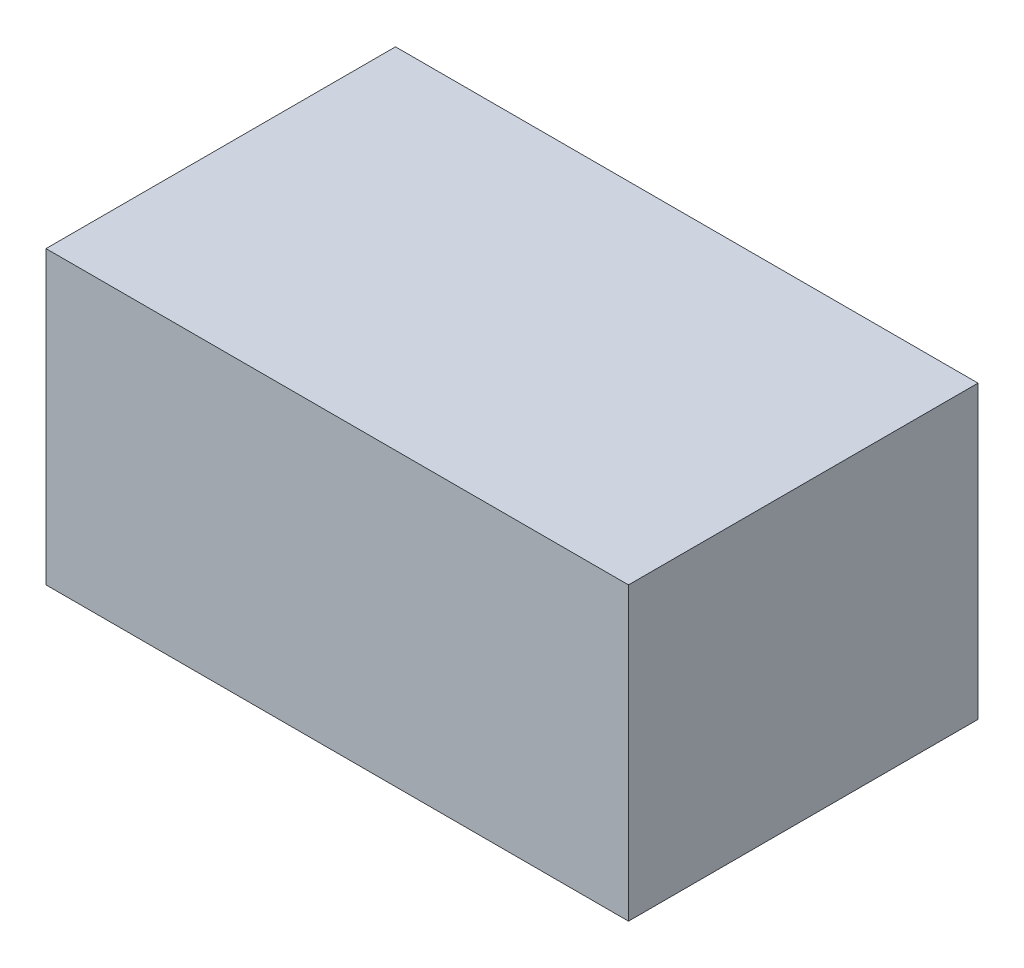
from build123d import *

# Parameters (mm, degrees)
SKIZZE1_W                 = 100
SKIZZE1_H                 = 60
LINEAR_AUSTRAGEN1_DEPTH   = 50
M12_GEWINDEBOHRUNG1_D     = 10.2
M12_GEWINDEBOHRUNG1_DEPTH = 32.75
M12_GEWINDEBOHRUNG1_TIP   = 3.064389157


with BuildPart() as part:
    # Skizze1 → Linear austragen1 (new body)
    with BuildSketch(Plane(origin=(0, 0, 0), x_dir=(1, 0, 0), z_dir=(0, 1, 0))):
        with Locations((50, -30)):
            Rectangle(SKIZZE1_W, SKIZZE1_H)
    extrude(amount=LINEAR_AUSTRAGEN1_DEPTH)

    # M12 Gewindebohrung1
    with Locations(Plane.XZ):
        with Locations((75, 30), (25, 30)):
            Hole(M12_GEWINDEBOHRUNG1_D / 2, depth=M12_GEWINDEBOHRUNG1_DEPTH)
            with Locations((0, 0, -(M12_GEWINDEBOHRUNG1_DEPTH + M12_GEWINDEBOHRUNG1_TIP / 2))):  # 118° drill point
                Cone(0, M12_GEWINDEBOHRUNG1_D / 2, M12_GEWINDEBOHRUNG1_TIP, mode=Mode.SUBTRACT)


solid = part.part
